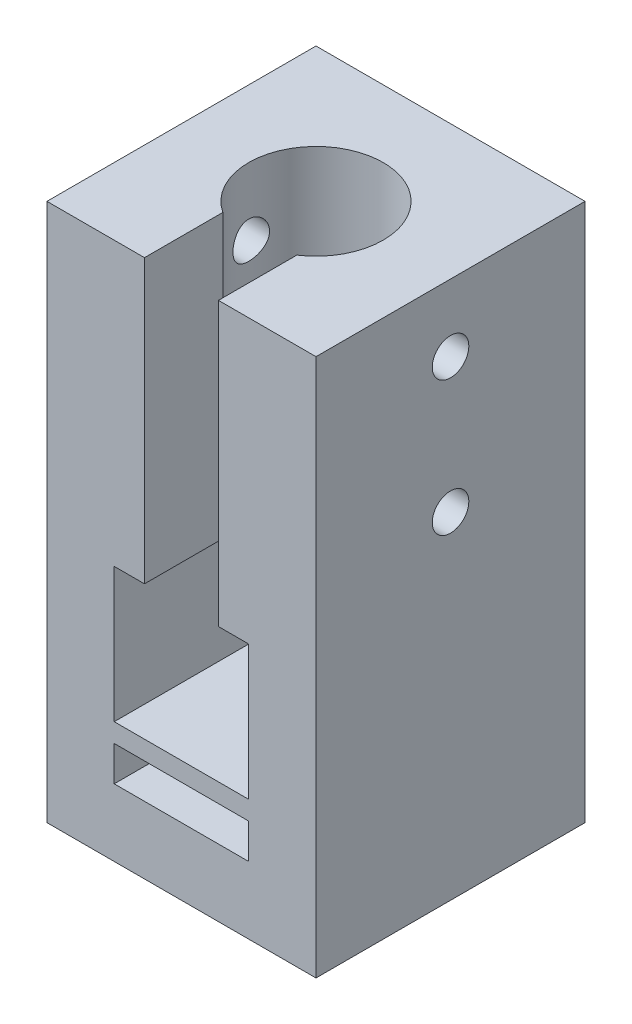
from build123d import *

# Parameters (mm, degrees)
SKETCH1_W                  = 25.4
SKETCH1_H                  = 25.4
BOSS_EXTRUDE1_DEPTH        = 50.8
SKETCH2_R                  = 6.35
CUT_EXTRUDE1_DEPTH         = 25.4
SKETCH3_R                  = 3.81
CUT_EXTRUDE3_DEPTH         = 19.05
SKETCH4_W                  = 6.985
SKETCH4_H                  = 12.7
CUT_EXTRUDE4_DEPTH         = 38.1
SKETCH5_W                  = 12.7
SKETCH5_H                  = 12.7
CUT_EXTRUDE5_DEPTH         = 69.123922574
SKETCH8_W                  = 12.7
SKETCH8_H                  = 3.302
CUT_EXTRUDE7_DEPTH         = 12.7
F_8_32_TAPPED_HOLE1_REACH  = 63.455
F_8_32_TAPPED_HOLE1_BORE_R = 1.7272
F_8_32_TAPPED_HOLE2_D      = 3.4544


with BuildPart() as part:
    # Sketch1 → Boss-Extrude1 (new body)
    with BuildSketch(Plane(origin=(0, 0, 0), x_dir=(1, 0, 0), z_dir=(0, 1, 0))):
        with Locations((-24.917400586, 10.770902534)):
            Rectangle(SKETCH1_W, SKETCH1_H)
    extrude(amount=BOSS_EXTRUDE1_DEPTH)

    # Sketch2 → Cut-Extrude1 (cut)
    with BuildSketch(Plane(origin=(0, 50.8, 0), x_dir=(1, 0, 0), z_dir=(0, 1, 0))):
        with Locations(Location((-24.917400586, 10.770902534, 0), (0, 0, 270))):
            Circle(SKETCH2_R)
    extrude(amount=-CUT_EXTRUDE1_DEPTH, mode=Mode.SUBTRACT)

    # Sketch3 → Cut-Extrude3 (cut)
    with BuildSketch(Plane(origin=(0, 25.4, 0), x_dir=(1, 0, 0), z_dir=(0, 1, 0))):
        with Locations(Location((-24.917400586, 10.770902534, 0), (0, 0, 270))):
            Circle(SKETCH3_R)
    extrude(amount=-CUT_EXTRUDE3_DEPTH, mode=Mode.SUBTRACT)

    # Sketch4 → Cut-Extrude4 (cut)
    with BuildSketch(Plane(origin=(0, 50.8, 0), x_dir=(1, 0, 0), z_dir=(0, 1, 0))):
        with Locations((-24.917400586, 4.420902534)):
            Rectangle(SKETCH4_W, SKETCH4_H)
    extrude(amount=-CUT_EXTRUDE4_DEPTH, mode=Mode.SUBTRACT)

    # Sketch5 → Cut-Extrude5 (cut, through all)
    with BuildSketch(Plane.XY.offset(1.929097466)):
        with Locations((-24.917400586, 17.78)):
            Rectangle(SKETCH5_W, SKETCH5_H)
    extrude(amount=-CUT_EXTRUDE5_DEPTH, mode=Mode.SUBTRACT)

    # Sketch8 → Cut-Extrude7 (cut)
    with BuildSketch(Plane.XY.offset(1.929097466)):
        with Locations((-24.917400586, 8.001)):
            Rectangle(SKETCH8_W, SKETCH8_H)
    extrude(amount=-CUT_EXTRUDE7_DEPTH, mode=Mode.SUBTRACT)

    # 8-32 Tapped Hole1 bore → 8-32 Tapped Hole1 (cut, up to next)
    with BuildSketch(Plane(origin=(-12.217400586, 0, 0), x_dir=(0, 0, -1), z_dir=(1, 0, 0)), mode=Mode.PRIVATE) as f_8_32_tapped_hole1_sk1:
        with Locations((10.770902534, 44.45)):
            Circle(F_8_32_TAPPED_HOLE1_BORE_R)
    f_8_32_tapped_hole1_tool1 = extrude(f_8_32_tapped_hole1_sk1.sketch, amount=-F_8_32_TAPPED_HOLE1_REACH, mode=Mode.PRIVATE) & part.part
    # 8-32 Tapped Hole1 bore → 8-32 Tapped Hole1 (cut, up to next)
    with BuildSketch(Plane(origin=(-12.217400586, 0, 0), x_dir=(0, 0, -1), z_dir=(1, 0, 0)), mode=Mode.PRIVATE) as f_8_32_tapped_hole1_sk2:
        with Locations((10.770902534, 31.75)):
            Circle(F_8_32_TAPPED_HOLE1_BORE_R)
    f_8_32_tapped_hole1_tool2 = extrude(f_8_32_tapped_hole1_sk2.sketch, amount=-F_8_32_TAPPED_HOLE1_REACH, mode=Mode.PRIVATE) & part.part
    add(f_8_32_tapped_hole1_tool1.solids().sort_by_distance((-12.217401, 44.45, -10.770903))[0], mode=Mode.SUBTRACT)
    add(f_8_32_tapped_hole1_tool2.solids().sort_by_distance((-12.217401, 31.75, -10.770903))[0], mode=Mode.SUBTRACT)

    # 8-32 Tapped Hole2 (through all)
    with Locations(Plane.ZY.offset(37.617400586)):
        with Locations((-10.770902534, 44.45), (-10.770902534, 31.75)):
            Hole(F_8_32_TAPPED_HOLE2_D / 2)


solid = part.part
